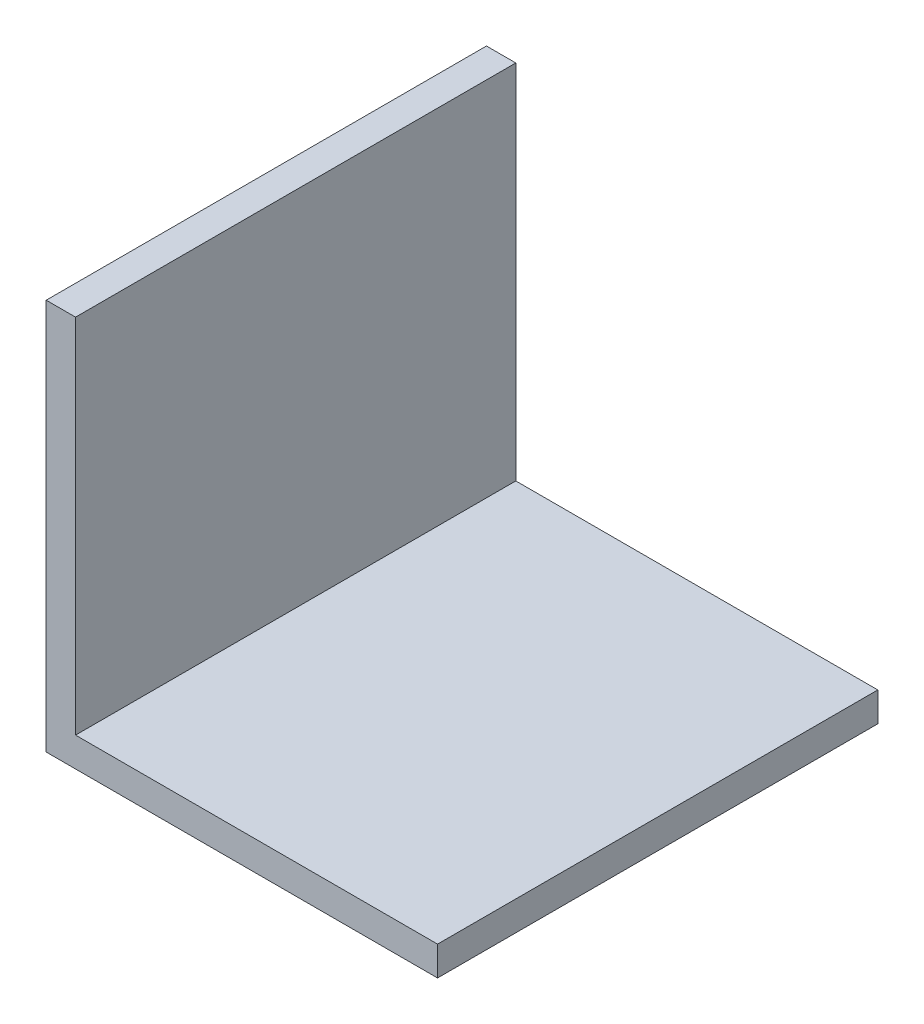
from build123d import *

# Parameters (mm, degrees)
EXTRUSION1_DEPTH = 90


with BuildPart() as part:
    # Esquisse1 → Extrusion1 (new body)
    with BuildSketch(Plane.XY):
        Polygon((0, 0), (80, 0), (80, 6), (6, 6), (6, 80), (0, 80), align=None)
    extrude(amount=EXTRUSION1_DEPTH)


solid = part.part
